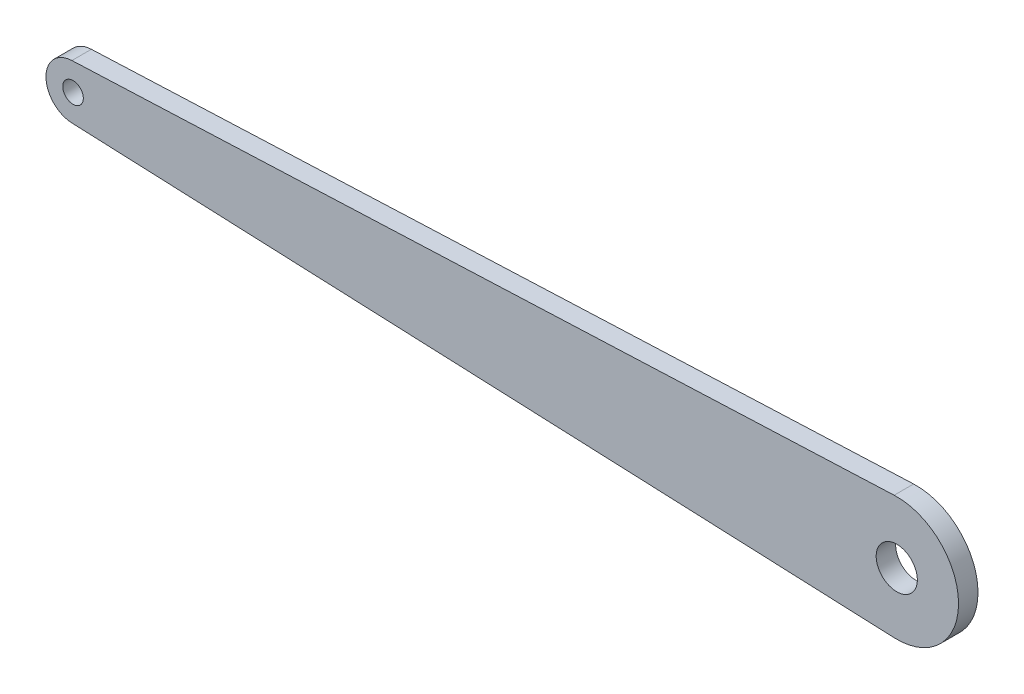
from build123d import *

# Parameters (mm, degrees)
SKETCH1_R           = 1.5875
SKETCH1_R_2         = 3.175
BOSS_EXTRUDE1_DEPTH = 3


with BuildPart() as part:
    # Sketch1 → Boss-Extrude1 (new body)
    with BuildSketch(Plane.XY):
        with BuildLine():
            Line((-0.175875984, 4.171293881), (126.59875, 9.516544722))
            ThreePointArc((126.59875, 9.516544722), (136.525, 0), (126.59875, -9.516544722))
            Line((126.59875, -9.516544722), (-0.175875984, -4.171293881))
            ThreePointArc((-0.175875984, -4.171293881), (-4.175, 0), (-0.175875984, 4.171293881))
        make_face()
        Circle(SKETCH1_R, mode=Mode.SUBTRACT)
        with Locations((127, 0)):
            Circle(SKETCH1_R_2, mode=Mode.SUBTRACT)
    extrude(amount=BOSS_EXTRUDE1_DEPTH)


solid = part.part
